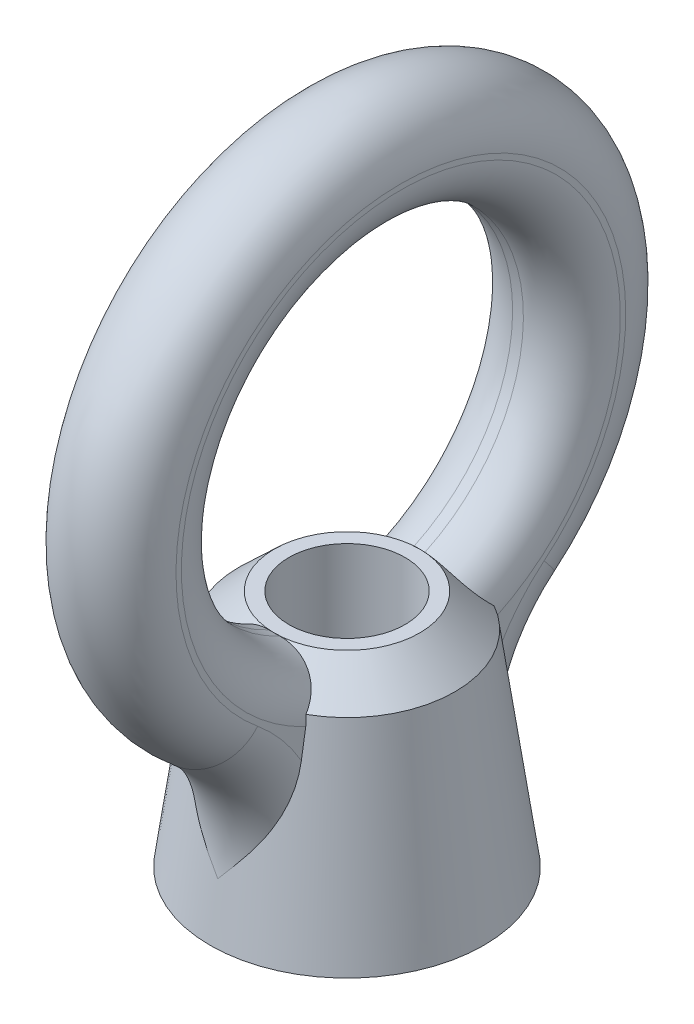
ISO-10303-21;
HEADER;
FILE_DESCRIPTION(('STEP AP214'),'2;1');
FILE_NAME('part.step','',(''),(''),'','','');
FILE_SCHEMA(('AUTOMOTIVE_DESIGN { 1 0 10303 214 1 1 1 1 }'));
ENDSEC;
DATA;
#1=APPLICATION_CONTEXT('core data for automotive mechanical design processes');
#2=APPLICATION_PROTOCOL_DEFINITION('international standard','automotive_design',2000,#1);
#3=PRODUCT_CONTEXT('',#1,'mechanical');
#4=PRODUCT('Part','Part','',(#3));
#5=PRODUCT_RELATED_PRODUCT_CATEGORY('part','',(#4));
#6=PRODUCT_DEFINITION_FORMATION('','',#4);
#7=PRODUCT_DEFINITION_CONTEXT('part definition',#1,'design');
#8=PRODUCT_DEFINITION('design','',#6,#7);
#9=PRODUCT_DEFINITION_SHAPE('','',#8);
#10=(LENGTH_UNIT() NAMED_UNIT(*) SI_UNIT(.MILLI.,.METRE.));
#11=(NAMED_UNIT(*) PLANE_ANGLE_UNIT() SI_UNIT($,.RADIAN.));
#12=(NAMED_UNIT(*) SI_UNIT($,.STERADIAN.) SOLID_ANGLE_UNIT());
#13=UNCERTAINTY_MEASURE_WITH_UNIT(LENGTH_MEASURE(1.E-05),#10,'distance_accuracy_value','');
#14=(GEOMETRIC_REPRESENTATION_CONTEXT(3) GLOBAL_UNCERTAINTY_ASSIGNED_CONTEXT((#13)) GLOBAL_UNIT_ASSIGNED_CONTEXT((#10,
#11,#12)) REPRESENTATION_CONTEXT('',''));
#15=CARTESIAN_POINT('',(0.,0.,0.));
#16=DIRECTION('',(0.,0.,1.));
#17=DIRECTION('',(1.,0.,0.));
#18=AXIS2_PLACEMENT_3D('',#15,#16,#17);
#19=CARTESIAN_POINT('',(0.,-18.7322191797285,15.4788231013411));
#20=DIRECTION('',(-1.,0.,0.));
#21=DIRECTION('',(0.,0.,1.));
#22=AXIS2_PLACEMENT_3D('',#19,#20,#21);
#23=TOROIDAL_SURFACE('',#22,11.15,3.15);
#24=CARTESIAN_POINT('',(0.,-19.8456039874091,7.55667855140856));
#25=CARTESIAN_POINT('',(-0.00377779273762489,-19.8410354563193,7.55603649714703));
#26=CARTESIAN_POINT('',(-0.00755579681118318,-19.8364674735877,7.55539167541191));
#27=CARTESIAN_POINT('',(-0.125643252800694,-19.6937116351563,7.53515114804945));
#28=CARTESIAN_POINT('',(-0.24012256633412,-19.5560100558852,7.51302191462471));
#29=CARTESIAN_POINT('',(-0.468015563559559,-19.280651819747,7.46350439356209));
#30=CARTESIAN_POINT('',(-0.581429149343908,-19.1429951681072,7.43611562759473));
#31=CARTESIAN_POINT('',(-0.805830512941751,-18.8667077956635,7.37610027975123));
#32=CARTESIAN_POINT('',(-0.916816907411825,-18.7280765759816,7.34347079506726));
#33=CARTESIAN_POINT('',(-1.13487946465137,-18.4490027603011,7.27325639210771));
#34=CARTESIAN_POINT('',(-1.24195577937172,-18.30856023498,7.23567166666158));
#35=CARTESIAN_POINT('',(-1.45064620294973,-18.0252440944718,7.15611617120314));
#36=CARTESIAN_POINT('',(-1.55226896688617,-17.8823748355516,7.11415268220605));
#37=CARTESIAN_POINT('',(-1.74892158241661,-17.5932481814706,7.02651705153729));
#38=CARTESIAN_POINT('',(-1.84395111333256,-17.4469906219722,6.98084472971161));
#39=CARTESIAN_POINT('',(-2.02609624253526,-17.1506459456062,6.88677246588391));
#40=CARTESIAN_POINT('',(-2.11321859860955,-17.0005622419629,6.83837491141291));
#41=CARTESIAN_POINT('',(-2.27850965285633,-16.6960915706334,6.73994112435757));
#42=CARTESIAN_POINT('',(-2.35668005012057,-16.5417054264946,6.68990520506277));
#43=CARTESIAN_POINT('',(-2.51582105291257,-16.201237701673,6.58071125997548));
#44=CARTESIAN_POINT('',(-2.59492719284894,-16.0143018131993,6.52147579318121));
#45=CARTESIAN_POINT('',(-2.73824234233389,-15.6343064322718,6.40457565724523));
#46=CARTESIAN_POINT('',(-2.80245156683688,-15.4412470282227,6.34691096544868));
#47=CARTESIAN_POINT('',(-2.91515012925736,-15.0492452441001,6.2351871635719));
#48=CARTESIAN_POINT('',(-2.96361808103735,-14.850295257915,6.18113303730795));
#49=CARTESIAN_POINT('',(-3.04413589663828,-14.4476688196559,6.07866370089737));
#50=CARTESIAN_POINT('',(-3.07618661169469,-14.2439926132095,6.03024819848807));
#51=CARTESIAN_POINT('',(-3.12371395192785,-13.831822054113,5.94040082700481));
#52=CARTESIAN_POINT('',(-3.13908520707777,-13.6233054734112,5.89901473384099));
#53=CARTESIAN_POINT('',(-3.15274159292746,-13.2041293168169,5.82482816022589));
#54=CARTESIAN_POINT('',(-3.15102259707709,-12.9934692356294,5.7920297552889));
#55=CARTESIAN_POINT('',(-3.13038275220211,-12.5722115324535,5.73585401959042));
#56=CARTESIAN_POINT('',(-3.1114998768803,-12.3616147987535,5.7124560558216));
#57=CARTESIAN_POINT('',(-3.05633264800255,-11.9419661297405,5.67526591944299));
#58=CARTESIAN_POINT('',(-3.02006194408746,-11.7329131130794,5.66146623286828));
#59=CARTESIAN_POINT('',(-2.95552182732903,-11.437208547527,5.64846588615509));
#60=CARTESIAN_POINT('',(-2.93457913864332,-11.3490686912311,5.64543092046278));
#61=CARTESIAN_POINT('',(-2.88937794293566,-11.1737238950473,5.64102394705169));
#62=CARTESIAN_POINT('',(-2.86512376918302,-11.0865178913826,5.63964978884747));
#63=CARTESIAN_POINT('',(-2.83916194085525,-10.9998,5.63907907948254));
#64=B_SPLINE_CURVE_WITH_KNOTS('',3,(#24,#25,#26,#27,#28,#29,#30,#31,#32,#33,#34,#35,#36,#37,#38,
#39,#40,#41,#42,#43,#44,#45,#46,#47,#48,#49,#50,#51,#52,#53,#54,#55,#56,#57,#58,#59,#60,#61,#62,
#63),.UNSPECIFIED.,.F.,.F.,(4,2,2,2,2,2,2,2,2,2,2,2,2,2,2,2,2,2,2,4),(0.,0.0178885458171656,
0.559107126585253,1.10037495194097,1.64194362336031,2.18349122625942,2.72415227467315,
3.26483960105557,3.8050603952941,4.34517848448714,4.97894479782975,5.61270196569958,
6.24731659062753,6.88189830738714,7.52046597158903,8.15918782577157,8.79649998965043,
9.43331267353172,9.70517970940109,9.97669434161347),.UNSPECIFIED.);
#65=CARTESIAN_POINT('',(0.,-19.8456039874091,7.55667855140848));
#66=VERTEX_POINT('',#65);
#67=CARTESIAN_POINT('',(-3.15,-13.1624752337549,5.81960717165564));
#68=VERTEX_POINT('',#67);
#69=EDGE_CURVE('E58',#66,#68,#64,.T.);
#70=ORIENTED_EDGE('',*,*,#69,.F.);
#71=CARTESIAN_POINT('',(0.,-19.8456039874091,7.55667855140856));
#72=CARTESIAN_POINT('',(0.00377779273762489,-19.8410354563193,7.55603649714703));
#73=CARTESIAN_POINT('',(0.00755579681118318,-19.8364674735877,7.55539167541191));
#74=CARTESIAN_POINT('',(0.125643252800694,-19.6937116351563,7.53515114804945));
#75=CARTESIAN_POINT('',(0.24012256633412,-19.5560100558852,7.51302191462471));
#76=CARTESIAN_POINT('',(0.468015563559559,-19.280651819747,7.46350439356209));
#77=CARTESIAN_POINT('',(0.581429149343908,-19.1429951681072,7.43611562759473));
#78=CARTESIAN_POINT('',(0.805830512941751,-18.8667077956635,7.37610027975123));
#79=CARTESIAN_POINT('',(0.916816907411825,-18.7280765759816,7.34347079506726));
#80=CARTESIAN_POINT('',(1.13487946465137,-18.4490027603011,7.27325639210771));
#81=CARTESIAN_POINT('',(1.24195577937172,-18.30856023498,7.23567166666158));
#82=CARTESIAN_POINT('',(1.45064620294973,-18.0252440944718,7.15611617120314));
#83=CARTESIAN_POINT('',(1.55226896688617,-17.8823748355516,7.11415268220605));
#84=CARTESIAN_POINT('',(1.74892158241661,-17.5932481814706,7.02651705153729));
#85=CARTESIAN_POINT('',(1.84395111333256,-17.4469906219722,6.98084472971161));
#86=CARTESIAN_POINT('',(2.02609624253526,-17.1506459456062,6.88677246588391));
#87=CARTESIAN_POINT('',(2.11321859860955,-17.0005622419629,6.83837491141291));
#88=CARTESIAN_POINT('',(2.27850965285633,-16.6960915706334,6.73994112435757));
#89=CARTESIAN_POINT('',(2.35668005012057,-16.5417054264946,6.68990520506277));
#90=CARTESIAN_POINT('',(2.51582105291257,-16.201237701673,6.58071125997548));
#91=CARTESIAN_POINT('',(2.59492719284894,-16.0143018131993,6.52147579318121));
#92=CARTESIAN_POINT('',(2.73824234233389,-15.6343064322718,6.40457565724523));
#93=CARTESIAN_POINT('',(2.80245156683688,-15.4412470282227,6.34691096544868));
#94=CARTESIAN_POINT('',(2.91515012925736,-15.0492452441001,6.2351871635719));
#95=CARTESIAN_POINT('',(2.96361808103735,-14.850295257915,6.18113303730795));
#96=CARTESIAN_POINT('',(3.04413589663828,-14.4476688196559,6.07866370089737));
#97=CARTESIAN_POINT('',(3.07618661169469,-14.2439926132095,6.03024819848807));
#98=CARTESIAN_POINT('',(3.12371395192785,-13.831822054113,5.94040082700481));
#99=CARTESIAN_POINT('',(3.13908520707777,-13.6233054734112,5.89901473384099));
#100=CARTESIAN_POINT('',(3.15274159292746,-13.2041293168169,5.82482816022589));
#101=CARTESIAN_POINT('',(3.15102259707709,-12.9934692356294,5.7920297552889));
#102=CARTESIAN_POINT('',(3.13038275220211,-12.5722115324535,5.73585401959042));
#103=CARTESIAN_POINT('',(3.1114998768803,-12.3616147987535,5.7124560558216));
#104=CARTESIAN_POINT('',(3.05633264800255,-11.9419661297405,5.67526591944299));
#105=CARTESIAN_POINT('',(3.02006194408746,-11.7329131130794,5.66146623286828));
#106=CARTESIAN_POINT('',(2.95552182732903,-11.437208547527,5.64846588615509));
#107=CARTESIAN_POINT('',(2.93457913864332,-11.3490686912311,5.64543092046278));
#108=CARTESIAN_POINT('',(2.88937794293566,-11.1737238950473,5.64102394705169));
#109=CARTESIAN_POINT('',(2.86512376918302,-11.0865178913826,5.63964978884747));
#110=CARTESIAN_POINT('',(2.83916194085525,-10.9998,5.63907907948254));
#111=B_SPLINE_CURVE_WITH_KNOTS('',3,(#71,#72,#73,#74,#75,#76,#77,#78,#79,#80,#81,#82,#83,#84,
#85,#86,#87,#88,#89,#90,#91,#92,#93,#94,#95,#96,#97,#98,#99,#100,#101,#102,#103,#104,#105,#106,
#107,#108,#109,#110),.UNSPECIFIED.,.F.,.F.,(4,2,2,2,2,2,2,2,2,2,2,2,2,2,2,2,2,2,2,4),(0.,
0.0178885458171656,0.559107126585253,1.10037495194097,1.64194362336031,2.18349122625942,
2.72415227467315,3.26483960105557,3.8050603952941,4.34517848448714,4.97894479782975,
5.61270196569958,6.24731659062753,6.88189830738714,7.52046597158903,8.15918782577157,
8.79649998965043,9.43331267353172,9.70517970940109,9.97669434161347),.UNSPECIFIED.);
#112=CARTESIAN_POINT('',(3.15,-13.1624752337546,5.81960717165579));
#113=VERTEX_POINT('',#112);
#114=EDGE_CURVE('E427',#113,#66,#111,.F.);
#115=ORIENTED_EDGE('',*,*,#114,.F.);
#116=CARTESIAN_POINT('',(3.15,-18.7322191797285,15.4788231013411));
#117=DIRECTION('',(1.,0.,0.));
#118=DIRECTION('',(0.,0.,-1.));
#119=AXIS2_PLACEMENT_3D('',#116,#117,#118);
#120=CIRCLE('',#119,11.15);
#121=CARTESIAN_POINT('',(3.15,-10.136982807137,8.37640015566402));
#122=VERTEX_POINT('',#121);
#123=EDGE_CURVE('E437',#122,#113,#120,.F.);
#124=ORIENTED_EDGE('',*,*,#123,.F.);
#125=CARTESIAN_POINT('',(0.,-10.136982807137,8.37640015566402));
#126=DIRECTION('',(0.,-0.636988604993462,-0.770873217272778));
#127=DIRECTION('',(0.,0.770873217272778,-0.636988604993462));
#128=AXIS2_PLACEMENT_3D('',#125,#126,#127);
#129=CIRCLE('',#128,3.15);
#130=CARTESIAN_POINT('',(-3.15,-10.136982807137,8.37640015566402));
#131=VERTEX_POINT('',#130);
#132=EDGE_CURVE('E280',#122,#131,#129,.T.);
#133=ORIENTED_EDGE('',*,*,#132,.T.);
#134=CARTESIAN_POINT('',(-3.15,-18.7322191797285,15.4788231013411));
#135=DIRECTION('',(1.,0.,0.));
#136=DIRECTION('',(0.,0.,-1.));
#137=AXIS2_PLACEMENT_3D('',#134,#135,#136);
#138=CIRCLE('',#137,11.15);
#139=EDGE_CURVE('E282',#68,#131,#138,.T.);
#140=ORIENTED_EDGE('',*,*,#139,.F.);
#141=EDGE_LOOP('',(#70,#115,#124,#133,#140));
#142=FACE_BOUND('',#141,.T.);
#143=ADVANCED_FACE('F33',(#142),#23,.T.);
#144=CARTESIAN_POINT('',(0.,0.,0.));
#145=DIRECTION('',(1.,0.,0.));
#146=DIRECTION('',(0.,0.,-1.));
#147=AXIS2_PLACEMENT_3D('',#144,#145,#146);
#148=TOROIDAL_SURFACE('',#147,13.15,3.15);
#149=ORIENTED_EDGE('',*,*,#132,.F.);
#150=CARTESIAN_POINT('',(3.15,0.,0.));
#151=DIRECTION('',(1.,0.,0.));
#152=DIRECTION('',(0.,0.,-1.));
#153=AXIS2_PLACEMENT_3D('',#150,#151,#152);
#154=CIRCLE('',#153,13.15);
#155=CARTESIAN_POINT('',(3.15,-10.136982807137,-8.37640015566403));
#156=VERTEX_POINT('',#155);
#157=EDGE_CURVE('E438',#156,#122,#154,.T.);
#158=ORIENTED_EDGE('',*,*,#157,.F.);
#159=CARTESIAN_POINT('',(0.,-10.136982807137,-8.37640015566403));
#160=DIRECTION('',(0.,0.636988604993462,-0.770873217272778));
#161=DIRECTION('',(0.,0.770873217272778,0.636988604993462));
#162=AXIS2_PLACEMENT_3D('',#159,#160,#161);
#163=CIRCLE('',#162,3.15);
#164=CARTESIAN_POINT('',(-3.15,-10.136982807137,-8.37640015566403));
#165=VERTEX_POINT('',#164);
#166=EDGE_CURVE('E278',#156,#165,#163,.T.);
#167=ORIENTED_EDGE('',*,*,#166,.T.);
#168=CARTESIAN_POINT('',(-3.15,0.,0.));
#169=DIRECTION('',(1.,0.,0.));
#170=DIRECTION('',(0.,0.,-1.));
#171=AXIS2_PLACEMENT_3D('',#168,#169,#170);
#172=CIRCLE('',#171,13.15);
#173=EDGE_CURVE('E276',#131,#165,#172,.F.);
#174=ORIENTED_EDGE('',*,*,#173,.F.);
#175=EDGE_LOOP('',(#149,#158,#167,#174));
#176=FACE_BOUND('',#175,.T.);
#177=ADVANCED_FACE('F304',(#176),#148,.T.);
#178=CARTESIAN_POINT('',(0.,-18.7322191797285,-15.4788231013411));
#179=DIRECTION('',(-1.,0.,0.));
#180=DIRECTION('',(0.,0.,1.));
#181=AXIS2_PLACEMENT_3D('',#178,#179,#180);
#182=TOROIDAL_SURFACE('',#181,11.15,3.15);
#183=CARTESIAN_POINT('',(0.,-19.8456039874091,-7.55667855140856));
#184=CARTESIAN_POINT('',(0.00377779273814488,-19.8410354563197,-7.55603649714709));
#185=CARTESIAN_POINT('',(0.00755579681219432,-19.8364674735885,-7.55539167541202));
#186=CARTESIAN_POINT('',(0.125643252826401,-19.6937116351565,-7.53515114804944));
#187=CARTESIAN_POINT('',(0.240122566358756,-19.556010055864,-7.51302191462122));
#188=CARTESIAN_POINT('',(0.468015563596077,-19.2806518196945,-7.46350439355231));
#189=CARTESIAN_POINT('',(0.581429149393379,-19.1429951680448,-7.43611562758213));
#190=CARTESIAN_POINT('',(0.805830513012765,-18.8667077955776,-7.37610027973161));
#191=CARTESIAN_POINT('',(0.916816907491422,-18.7280765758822,-7.34347079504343));
#192=CARTESIAN_POINT('',(1.13487946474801,-18.449002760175,-7.2732563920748));
#193=CARTESIAN_POINT('',(1.24195577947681,-18.3085602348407,-7.2356716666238));
#194=CARTESIAN_POINT('',(1.4506462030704,-18.0252440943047,-7.15611617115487));
#195=CARTESIAN_POINT('',(1.55226896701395,-17.8823748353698,-7.11415268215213));
#196=CARTESIAN_POINT('',(1.7489215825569,-17.5932481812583,-7.02651705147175));
#197=CARTESIAN_POINT('',(1.84395111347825,-17.4469906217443,-6.98084472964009));
#198=CARTESIAN_POINT('',(2.02609624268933,-17.1506459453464,-6.88677246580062));
#199=CARTESIAN_POINT('',(2.11321859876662,-17.0005622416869,-6.83837491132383));
#200=CARTESIAN_POINT('',(2.27850965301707,-16.696091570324,-6.73994112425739));
#201=CARTESIAN_POINT('',(2.35668005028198,-16.5417054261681,-6.68990520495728));
#202=CARTESIAN_POINT('',(2.51582105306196,-16.2012377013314,-6.58071125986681));
#203=CARTESIAN_POINT('',(2.59492719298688,-16.0143018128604,-6.52147579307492));
#204=CARTESIAN_POINT('',(2.73824234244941,-15.6343064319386,-6.40457565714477));
#205=CARTESIAN_POINT('',(2.80245156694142,-15.4412470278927,-6.34691096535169));
#206=CARTESIAN_POINT('',(2.91515012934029,-15.049245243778,-6.23518716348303));
#207=CARTESIAN_POINT('',(2.96361808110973,-14.8502952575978,-6.18113303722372));
#208=CARTESIAN_POINT('',(3.04413589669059,-14.4476688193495,-6.07866370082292));
#209=CARTESIAN_POINT('',(3.0761866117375,-14.2439926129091,-6.03024819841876));
#210=CARTESIAN_POINT('',(3.12371395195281,-13.8318220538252,-5.94040082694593));
#211=CARTESIAN_POINT('',(3.13908520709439,-13.6233054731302,-5.89901473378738));
#212=CARTESIAN_POINT('',(3.15274159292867,-13.2041293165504,-5.82482816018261));
#213=CARTESIAN_POINT('',(3.15102259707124,-12.9934692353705,-5.79202975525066));
#214=CARTESIAN_POINT('',(3.13038275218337,-12.5722115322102,-5.73585401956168));
#215=CARTESIAN_POINT('',(3.11149987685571,-12.3616147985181,-5.71245605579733));
#216=CARTESIAN_POINT('',(3.05633264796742,-11.9419661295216,-5.67526591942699));
#217=CARTESIAN_POINT('',(3.02006194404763,-11.732913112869,-5.66146623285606));
#218=CARTESIAN_POINT('',(2.95552182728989,-11.4372085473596,-5.64846588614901));
#219=CARTESIAN_POINT('',(2.93457913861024,-11.3490686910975,-5.6454309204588));
#220=CARTESIAN_POINT('',(2.88937794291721,-11.173723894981,-5.64102394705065));
#221=CARTESIAN_POINT('',(2.86512376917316,-11.0865178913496,-5.63964978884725));
#222=CARTESIAN_POINT('',(2.83916194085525,-10.9998,-5.63907907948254));
#223=B_SPLINE_CURVE_WITH_KNOTS('',3,(#183,#184,#185,#186,#187,#188,#189,#190,#191,#192,#193,
#194,#195,#196,#197,#198,#199,#200,#201,#202,#203,#204,#205,#206,#207,#208,#209,#210,#211,#212,
#213,#214,#215,#216,#217,#218,#219,#220,#221,#222),.UNSPECIFIED.,.F.,.F.,(4,2,2,2,2,2,2,2,2,2,2,
2,2,2,2,2,2,2,2,4),(0.,0.0178885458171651,0.559107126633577,1.10037495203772,1.64194362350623,
2.18349122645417,2.72415227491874,3.26483960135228,3.80506039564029,4.34517848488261,
4.97894479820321,5.61270196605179,6.24731659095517,6.88189830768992,7.52046597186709,
8.159187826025,8.79649998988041,9.4333126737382,9.70517970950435,9.97669434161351),.UNSPECIFIED.);
#224=CARTESIAN_POINT('',(0.,-19.8456039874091,-7.55667855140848));
#225=VERTEX_POINT('',#224);
#226=CARTESIAN_POINT('',(3.15,-13.1624752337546,-5.81960717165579));
#227=VERTEX_POINT('',#226);
#228=EDGE_CURVE('E50',#225,#227,#223,.T.);
#229=ORIENTED_EDGE('',*,*,#228,.F.);
#230=CARTESIAN_POINT('',(0.,-19.8456039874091,-7.55667855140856));
#231=CARTESIAN_POINT('',(-0.00377779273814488,-19.8410354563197,-7.55603649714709));
#232=CARTESIAN_POINT('',(-0.00755579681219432,-19.8364674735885,-7.55539167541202));
#233=CARTESIAN_POINT('',(-0.125643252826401,-19.6937116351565,-7.53515114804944));
#234=CARTESIAN_POINT('',(-0.240122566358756,-19.556010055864,-7.51302191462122));
#235=CARTESIAN_POINT('',(-0.468015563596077,-19.2806518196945,-7.46350439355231));
#236=CARTESIAN_POINT('',(-0.581429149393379,-19.1429951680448,-7.43611562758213));
#237=CARTESIAN_POINT('',(-0.805830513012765,-18.8667077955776,-7.37610027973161));
#238=CARTESIAN_POINT('',(-0.916816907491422,-18.7280765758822,-7.34347079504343));
#239=CARTESIAN_POINT('',(-1.13487946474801,-18.449002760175,-7.2732563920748));
#240=CARTESIAN_POINT('',(-1.24195577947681,-18.3085602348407,-7.2356716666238));
#241=CARTESIAN_POINT('',(-1.4506462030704,-18.0252440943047,-7.15611617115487));
#242=CARTESIAN_POINT('',(-1.55226896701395,-17.8823748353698,-7.11415268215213));
#243=CARTESIAN_POINT('',(-1.7489215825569,-17.5932481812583,-7.02651705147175));
#244=CARTESIAN_POINT('',(-1.84395111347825,-17.4469906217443,-6.98084472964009));
#245=CARTESIAN_POINT('',(-2.02609624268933,-17.1506459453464,-6.88677246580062));
#246=CARTESIAN_POINT('',(-2.11321859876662,-17.0005622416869,-6.83837491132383));
#247=CARTESIAN_POINT('',(-2.27850965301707,-16.696091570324,-6.73994112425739));
#248=CARTESIAN_POINT('',(-2.35668005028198,-16.5417054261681,-6.68990520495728));
#249=CARTESIAN_POINT('',(-2.51582105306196,-16.2012377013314,-6.58071125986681));
#250=CARTESIAN_POINT('',(-2.59492719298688,-16.0143018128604,-6.52147579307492));
#251=CARTESIAN_POINT('',(-2.73824234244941,-15.6343064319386,-6.40457565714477));
#252=CARTESIAN_POINT('',(-2.80245156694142,-15.4412470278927,-6.34691096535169));
#253=CARTESIAN_POINT('',(-2.91515012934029,-15.049245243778,-6.23518716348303));
#254=CARTESIAN_POINT('',(-2.96361808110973,-14.8502952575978,-6.18113303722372));
#255=CARTESIAN_POINT('',(-3.04413589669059,-14.4476688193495,-6.07866370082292));
#256=CARTESIAN_POINT('',(-3.0761866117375,-14.2439926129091,-6.03024819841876));
#257=CARTESIAN_POINT('',(-3.12371395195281,-13.8318220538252,-5.94040082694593));
#258=CARTESIAN_POINT('',(-3.13908520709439,-13.6233054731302,-5.89901473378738));
#259=CARTESIAN_POINT('',(-3.15274159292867,-13.2041293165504,-5.82482816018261));
#260=CARTESIAN_POINT('',(-3.15102259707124,-12.9934692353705,-5.79202975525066));
#261=CARTESIAN_POINT('',(-3.13038275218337,-12.5722115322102,-5.73585401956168));
#262=CARTESIAN_POINT('',(-3.11149987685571,-12.3616147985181,-5.71245605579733));
#263=CARTESIAN_POINT('',(-3.05633264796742,-11.9419661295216,-5.67526591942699));
#264=CARTESIAN_POINT('',(-3.02006194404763,-11.732913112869,-5.66146623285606));
#265=CARTESIAN_POINT('',(-2.95552182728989,-11.4372085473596,-5.64846588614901));
#266=CARTESIAN_POINT('',(-2.93457913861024,-11.3490686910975,-5.6454309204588));
#267=CARTESIAN_POINT('',(-2.88937794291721,-11.173723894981,-5.64102394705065));
#268=CARTESIAN_POINT('',(-2.86512376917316,-11.0865178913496,-5.63964978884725));
#269=CARTESIAN_POINT('',(-2.83916194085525,-10.9998,-5.63907907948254));
#270=B_SPLINE_CURVE_WITH_KNOTS('',3,(#230,#231,#232,#233,#234,#235,#236,#237,#238,#239,#240,
#241,#242,#243,#244,#245,#246,#247,#248,#249,#250,#251,#252,#253,#254,#255,#256,#257,#258,#259,
#260,#261,#262,#263,#264,#265,#266,#267,#268,#269),.UNSPECIFIED.,.F.,.F.,(4,2,2,2,2,2,2,2,2,2,2,
2,2,2,2,2,2,2,2,4),(0.,0.0178885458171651,0.559107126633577,1.10037495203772,1.64194362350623,
2.18349122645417,2.72415227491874,3.26483960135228,3.80506039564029,4.34517848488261,
4.97894479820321,5.61270196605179,6.24731659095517,6.88189830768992,7.52046597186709,
8.159187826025,8.79649998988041,9.4333126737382,9.70517970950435,9.97669434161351),.UNSPECIFIED.);
#271=CARTESIAN_POINT('',(-3.15,-13.1624752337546,-5.81960717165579));
#272=VERTEX_POINT('',#271);
#273=EDGE_CURVE('E195',#272,#225,#270,.F.);
#274=ORIENTED_EDGE('',*,*,#273,.F.);
#275=CARTESIAN_POINT('',(-3.15,-18.7322191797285,-15.4788231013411));
#276=DIRECTION('',(1.,0.,0.));
#277=DIRECTION('',(0.,0.,-1.));
#278=AXIS2_PLACEMENT_3D('',#275,#276,#277);
#279=CIRCLE('',#278,11.15);
#280=EDGE_CURVE('E274',#165,#272,#279,.T.);
#281=ORIENTED_EDGE('',*,*,#280,.F.);
#282=ORIENTED_EDGE('',*,*,#166,.F.);
#283=CARTESIAN_POINT('',(3.15,-18.7322191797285,-15.4788231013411));
#284=DIRECTION('',(1.,0.,0.));
#285=DIRECTION('',(0.,0.,-1.));
#286=AXIS2_PLACEMENT_3D('',#283,#284,#285);
#287=CIRCLE('',#286,11.15);
#288=EDGE_CURVE('E446',#227,#156,#287,.F.);
#289=ORIENTED_EDGE('',*,*,#288,.F.);
#290=EDGE_LOOP('',(#229,#274,#281,#282,#289));
#291=FACE_BOUND('',#290,.T.);
#292=ADVANCED_FACE('F185',(#291),#182,.T.);
#293=CARTESIAN_POINT('',(3.15,0.,0.));
#294=DIRECTION('',(1.,0.,0.));
#295=DIRECTION('',(0.,0.,-1.));
#296=AXIS2_PLACEMENT_3D('',#293,#294,#295);
#297=PLANE('',#296);
#298=CARTESIAN_POINT('',(3.15,-31.524957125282,-8.64191113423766));
#299=CARTESIAN_POINT('',(3.15,-30.4551220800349,-8.48187544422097));
#300=CARTESIAN_POINT('',(3.15,-29.3853622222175,-8.32133856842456));
#301=CARTESIAN_POINT('',(3.15,-27.2460276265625,-7.99905016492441));
#302=CARTESIAN_POINT('',(3.15,-26.1764528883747,-7.837298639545));
#303=CARTESIAN_POINT('',(3.15,-22.9676605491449,-7.34984323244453));
#304=CARTESIAN_POINT('',(3.15,-20.8287667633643,-7.02199699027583));
#305=CARTESIAN_POINT('',(3.15,-17.6214369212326,-6.52374933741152));
#306=CARTESIAN_POINT('',(3.15,-16.5524976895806,-6.3565874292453));
#307=CARTESIAN_POINT('',(3.15,-14.4150607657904,-6.01951382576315));
#308=CARTESIAN_POINT('',(3.15,-13.3465630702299,-5.84960215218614));
#309=CARTESIAN_POINT('',(3.15,-11.2102841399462,-5.50625900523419));
#310=CARTESIAN_POINT('',(3.15,-10.1425028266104,-5.33282802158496));
#311=CARTESIAN_POINT('',(3.15,-8.00768017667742,-4.98126491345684));
#312=CARTESIAN_POINT('',(3.15,-6.94063886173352,-4.80313265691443));
#313=CARTESIAN_POINT('',(3.15,-5.34073276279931,-4.53101374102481));
#314=CARTESIAN_POINT('',(3.15,-4.80745219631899,-4.43947185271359));
#315=CARTESIAN_POINT('',(3.15,-3.74123434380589,-4.25441940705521));
#316=CARTESIAN_POINT('',(3.15,-3.20829705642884,-4.16090885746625));
#317=CARTESIAN_POINT('',(3.15,-2.14288992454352,-3.97150229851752));
#318=CARTESIAN_POINT('',(3.15,-1.61042004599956,-3.87560648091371));
#319=CARTESIAN_POINT('',(3.15,-0.546014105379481,-3.68084480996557));
#320=CARTESIAN_POINT('',(3.15,-0.0140780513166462,-3.58197891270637));
#321=CARTESIAN_POINT('',(3.15,1.04928257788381,-3.38043515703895));
#322=CARTESIAN_POINT('',(3.15,1.58070688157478,-3.27775586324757));
#323=CARTESIAN_POINT('',(3.15,2.64256376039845,-3.06746644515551));
#324=CARTESIAN_POINT('',(3.15,3.17299637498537,-2.9598565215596));
#325=CARTESIAN_POINT('',(3.15,3.96765700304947,-2.79334938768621));
#326=CARTESIAN_POINT('',(3.15,4.23241662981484,-2.73698995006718));
#327=CARTESIAN_POINT('',(3.15,4.76149086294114,-2.62223258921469));
#328=CARTESIAN_POINT('',(3.15,5.02580547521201,-2.5638346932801));
#329=CARTESIAN_POINT('',(3.15,5.55391817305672,-2.44457239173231));
#330=CARTESIAN_POINT('',(3.15,5.8177161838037,-2.38370765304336));
#331=CARTESIAN_POINT('',(3.15,6.3445859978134,-2.25886514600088));
#332=CARTESIAN_POINT('',(3.15,6.60765776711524,-2.19488723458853));
#333=CARTESIAN_POINT('',(3.15,6.87026738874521,-2.12902852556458));
#334=B_SPLINE_CURVE_WITH_KNOTS('',3,(#298,#299,#300,#301,#302,#303,#304,#305,#306,#307,#308,
#309,#310,#311,#312,#313,#314,#315,#316,#317,#318,#319,#320,#321,#322,#323,#324,#325,#326,#327,
#328,#329,#330,#331,#332,#333),.UNSPECIFIED.,.F.,.F.,(4,2,2,2,2,2,2,2,2,2,2,2,2,2,2,2,2,4),(0.,
3.24521519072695,6.49042417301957,12.9820309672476,16.2278207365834,19.4735848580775,
22.7189003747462,25.9643071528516,27.5875457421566,29.2107779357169,30.8338800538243,
32.4570061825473,34.0807495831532,35.7044269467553,36.5164959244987,37.3285540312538,
38.1407221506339,38.952927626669),.UNSPECIFIED.);
#335=CARTESIAN_POINT('',(3.15,-11.5666499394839,-5.563257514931));
#336=VERTEX_POINT('',#335);
#337=EDGE_CURVE('E204',#227,#336,#334,.T.);
#338=ORIENTED_EDGE('',*,*,#337,.F.);
#339=ORIENTED_EDGE('',*,*,#288,.T.);
#340=ORIENTED_EDGE('',*,*,#157,.T.);
#341=ORIENTED_EDGE('',*,*,#123,.T.);
#342=CARTESIAN_POINT('',(3.15,-31.524957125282,8.64191113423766));
#343=CARTESIAN_POINT('',(3.15,-30.4551220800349,8.48187544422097));
#344=CARTESIAN_POINT('',(3.15,-29.3853622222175,8.32133856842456));
#345=CARTESIAN_POINT('',(3.15,-27.2460276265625,7.99905016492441));
#346=CARTESIAN_POINT('',(3.15,-26.1764528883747,7.837298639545));
#347=CARTESIAN_POINT('',(3.15,-22.9676605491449,7.34984323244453));
#348=CARTESIAN_POINT('',(3.15,-20.8287667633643,7.02199699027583));
#349=CARTESIAN_POINT('',(3.15,-17.6214369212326,6.52374933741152));
#350=CARTESIAN_POINT('',(3.15,-16.5524976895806,6.3565874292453));
#351=CARTESIAN_POINT('',(3.15,-14.4150607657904,6.01951382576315));
#352=CARTESIAN_POINT('',(3.15,-13.3465630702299,5.84960215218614));
#353=CARTESIAN_POINT('',(3.15,-11.2102841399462,5.50625900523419));
#354=CARTESIAN_POINT('',(3.15,-10.1425028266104,5.33282802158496));
#355=CARTESIAN_POINT('',(3.15,-8.00768017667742,4.98126491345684));
#356=CARTESIAN_POINT('',(3.15,-6.94063886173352,4.80313265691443));
#357=CARTESIAN_POINT('',(3.15,-5.34073276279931,4.53101374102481));
#358=CARTESIAN_POINT('',(3.15,-4.80745219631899,4.43947185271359));
#359=CARTESIAN_POINT('',(3.15,-3.74123434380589,4.25441940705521));
#360=CARTESIAN_POINT('',(3.15,-3.20829705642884,4.16090885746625));
#361=CARTESIAN_POINT('',(3.15,-2.14288992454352,3.97150229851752));
#362=CARTESIAN_POINT('',(3.15,-1.61042004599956,3.87560648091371));
#363=CARTESIAN_POINT('',(3.15,-0.546014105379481,3.68084480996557));
#364=CARTESIAN_POINT('',(3.15,-0.0140780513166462,3.58197891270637));
#365=CARTESIAN_POINT('',(3.15,1.04928257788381,3.38043515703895));
#366=CARTESIAN_POINT('',(3.15,1.58070688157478,3.27775586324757));
#367=CARTESIAN_POINT('',(3.15,2.64256376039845,3.06746644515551));
#368=CARTESIAN_POINT('',(3.15,3.17299637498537,2.9598565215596));
#369=CARTESIAN_POINT('',(3.15,3.96765700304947,2.79334938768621));
#370=CARTESIAN_POINT('',(3.15,4.23241662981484,2.73698995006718));
#371=CARTESIAN_POINT('',(3.15,4.76149086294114,2.62223258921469));
#372=CARTESIAN_POINT('',(3.15,5.02580547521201,2.5638346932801));
#373=CARTESIAN_POINT('',(3.15,5.55391817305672,2.44457239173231));
#374=CARTESIAN_POINT('',(3.15,5.8177161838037,2.38370765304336));
#375=CARTESIAN_POINT('',(3.15,6.3445859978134,2.25886514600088));
#376=CARTESIAN_POINT('',(3.15,6.60765776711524,2.19488723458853));
#377=CARTESIAN_POINT('',(3.15,6.87026738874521,2.12902852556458));
#378=B_SPLINE_CURVE_WITH_KNOTS('',3,(#342,#343,#344,#345,#346,#347,#348,#349,#350,#351,#352,
#353,#354,#355,#356,#357,#358,#359,#360,#361,#362,#363,#364,#365,#366,#367,#368,#369,#370,#371,
#372,#373,#374,#375,#376,#377),.UNSPECIFIED.,.F.,.F.,(4,2,2,2,2,2,2,2,2,2,2,2,2,2,2,2,2,4),(0.,
3.24521519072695,6.49042417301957,12.9820309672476,16.2278207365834,19.4735848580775,
22.7189003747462,25.9643071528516,27.5875457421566,29.2107779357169,30.8338800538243,
32.4570061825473,34.0807495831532,35.7044269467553,36.5164959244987,37.3285540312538,
38.1407221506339,38.952927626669),.UNSPECIFIED.);
#379=CARTESIAN_POINT('',(3.15,-11.5666499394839,5.563257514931));
#380=VERTEX_POINT('',#379);
#381=EDGE_CURVE('E300',#380,#113,#378,.F.);
#382=ORIENTED_EDGE('',*,*,#381,.F.);
#383=CARTESIAN_POINT('',(3.15,0.,0.));
#384=DIRECTION('',(1.,0.,0.));
#385=DIRECTION('',(0.,0.,-1.));
#386=AXIS2_PLACEMENT_3D('',#383,#384,#385);
#387=CIRCLE('',#386,12.835);
#388=EDGE_CURVE('E269',#380,#336,#387,.F.);
#389=ORIENTED_EDGE('',*,*,#388,.T.);
#390=EDGE_LOOP('',(#338,#339,#340,#341,#382,#389));
#391=FACE_BOUND('',#390,.T.);
#392=ADVANCED_FACE('F181',(#391),#297,.T.);
#393=CARTESIAN_POINT('',(-3.15,0.,0.));
#394=DIRECTION('',(1.,0.,0.));
#395=DIRECTION('',(0.,0.,-1.));
#396=AXIS2_PLACEMENT_3D('',#393,#394,#395);
#397=PLANE('',#396);
#398=ORIENTED_EDGE('',*,*,#280,.T.);
#399=CARTESIAN_POINT('',(-3.15,-31.524957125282,-8.64191113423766));
#400=CARTESIAN_POINT('',(-3.15,-30.4551220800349,-8.48187544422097));
#401=CARTESIAN_POINT('',(-3.15,-29.3853622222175,-8.32133856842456));
#402=CARTESIAN_POINT('',(-3.15,-27.2460276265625,-7.99905016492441));
#403=CARTESIAN_POINT('',(-3.15,-26.1764528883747,-7.837298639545));
#404=CARTESIAN_POINT('',(-3.15,-22.9676605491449,-7.34984323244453));
#405=CARTESIAN_POINT('',(-3.15,-20.8287667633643,-7.02199699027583));
#406=CARTESIAN_POINT('',(-3.15,-17.6214369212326,-6.52374933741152));
#407=CARTESIAN_POINT('',(-3.15,-16.5524976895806,-6.3565874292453));
#408=CARTESIAN_POINT('',(-3.15,-14.4150607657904,-6.01951382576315));
#409=CARTESIAN_POINT('',(-3.15,-13.3465630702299,-5.84960215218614));
#410=CARTESIAN_POINT('',(-3.15,-11.2102841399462,-5.50625900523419));
#411=CARTESIAN_POINT('',(-3.15,-10.1425028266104,-5.33282802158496));
#412=CARTESIAN_POINT('',(-3.15,-8.00768017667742,-4.98126491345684));
#413=CARTESIAN_POINT('',(-3.15,-6.94063886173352,-4.80313265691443));
#414=CARTESIAN_POINT('',(-3.15,-5.34073276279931,-4.53101374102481));
#415=CARTESIAN_POINT('',(-3.15,-4.80745219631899,-4.43947185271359));
#416=CARTESIAN_POINT('',(-3.15,-3.74123434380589,-4.25441940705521));
#417=CARTESIAN_POINT('',(-3.15,-3.20829705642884,-4.16090885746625));
#418=CARTESIAN_POINT('',(-3.15,-2.14288992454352,-3.97150229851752));
#419=CARTESIAN_POINT('',(-3.15,-1.61042004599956,-3.87560648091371));
#420=CARTESIAN_POINT('',(-3.15,-0.546014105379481,-3.68084480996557));
#421=CARTESIAN_POINT('',(-3.15,-0.0140780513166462,-3.58197891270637));
#422=CARTESIAN_POINT('',(-3.15,1.04928257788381,-3.38043515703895));
#423=CARTESIAN_POINT('',(-3.15,1.58070688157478,-3.27775586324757));
#424=CARTESIAN_POINT('',(-3.15,2.64256376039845,-3.06746644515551));
#425=CARTESIAN_POINT('',(-3.15,3.17299637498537,-2.9598565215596));
#426=CARTESIAN_POINT('',(-3.15,3.96765700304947,-2.79334938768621));
#427=CARTESIAN_POINT('',(-3.15,4.23241662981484,-2.73698995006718));
#428=CARTESIAN_POINT('',(-3.15,4.76149086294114,-2.62223258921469));
#429=CARTESIAN_POINT('',(-3.15,5.02580547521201,-2.5638346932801));
#430=CARTESIAN_POINT('',(-3.15,5.55391817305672,-2.44457239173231));
#431=CARTESIAN_POINT('',(-3.15,5.8177161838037,-2.38370765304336));
#432=CARTESIAN_POINT('',(-3.15,6.3445859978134,-2.25886514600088));
#433=CARTESIAN_POINT('',(-3.15,6.60765776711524,-2.19488723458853));
#434=CARTESIAN_POINT('',(-3.15,6.87026738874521,-2.12902852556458));
#435=B_SPLINE_CURVE_WITH_KNOTS('',3,(#399,#400,#401,#402,#403,#404,#405,#406,#407,#408,#409,
#410,#411,#412,#413,#414,#415,#416,#417,#418,#419,#420,#421,#422,#423,#424,#425,#426,#427,#428,
#429,#430,#431,#432,#433,#434),.UNSPECIFIED.,.F.,.F.,(4,2,2,2,2,2,2,2,2,2,2,2,2,2,2,2,2,4),(0.,
3.24521519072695,6.49042417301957,12.9820309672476,16.2278207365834,19.4735848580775,
22.7189003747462,25.9643071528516,27.5875457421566,29.2107779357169,30.8338800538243,
32.4570061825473,34.0807495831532,35.7044269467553,36.5164959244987,37.3285540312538,
38.1407221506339,38.952927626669),.UNSPECIFIED.);
#436=CARTESIAN_POINT('',(-3.15,-11.5666499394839,-5.56325751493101));
#437=VERTEX_POINT('',#436);
#438=EDGE_CURVE('E189',#272,#437,#435,.T.);
#439=ORIENTED_EDGE('',*,*,#438,.T.);
#440=CARTESIAN_POINT('',(-3.15,0.,0.));
#441=DIRECTION('',(1.,0.,0.));
#442=DIRECTION('',(0.,0.,-1.));
#443=AXIS2_PLACEMENT_3D('',#440,#441,#442);
#444=CIRCLE('',#443,12.835);
#445=CARTESIAN_POINT('',(-3.15,-11.5666499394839,5.563257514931));
#446=VERTEX_POINT('',#445);
#447=EDGE_CURVE('E144',#437,#446,#444,.T.);
#448=ORIENTED_EDGE('',*,*,#447,.T.);
#449=CARTESIAN_POINT('',(-3.15,-31.524957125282,8.64191113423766));
#450=CARTESIAN_POINT('',(-3.15,-30.4551220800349,8.48187544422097));
#451=CARTESIAN_POINT('',(-3.15,-29.3853622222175,8.32133856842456));
#452=CARTESIAN_POINT('',(-3.15,-27.2460276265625,7.99905016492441));
#453=CARTESIAN_POINT('',(-3.15,-26.1764528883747,7.837298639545));
#454=CARTESIAN_POINT('',(-3.15,-22.9676605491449,7.34984323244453));
#455=CARTESIAN_POINT('',(-3.15,-20.8287667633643,7.02199699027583));
#456=CARTESIAN_POINT('',(-3.15,-17.6214369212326,6.52374933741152));
#457=CARTESIAN_POINT('',(-3.15,-16.5524976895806,6.3565874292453));
#458=CARTESIAN_POINT('',(-3.15,-14.4150607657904,6.01951382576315));
#459=CARTESIAN_POINT('',(-3.15,-13.3465630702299,5.84960215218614));
#460=CARTESIAN_POINT('',(-3.15,-11.2102841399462,5.50625900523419));
#461=CARTESIAN_POINT('',(-3.15,-10.1425028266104,5.33282802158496));
#462=CARTESIAN_POINT('',(-3.15,-8.00768017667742,4.98126491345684));
#463=CARTESIAN_POINT('',(-3.15,-6.94063886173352,4.80313265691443));
#464=CARTESIAN_POINT('',(-3.15,-5.34073276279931,4.53101374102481));
#465=CARTESIAN_POINT('',(-3.15,-4.80745219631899,4.43947185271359));
#466=CARTESIAN_POINT('',(-3.15,-3.74123434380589,4.25441940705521));
#467=CARTESIAN_POINT('',(-3.15,-3.20829705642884,4.16090885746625));
#468=CARTESIAN_POINT('',(-3.15,-2.14288992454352,3.97150229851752));
#469=CARTESIAN_POINT('',(-3.15,-1.61042004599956,3.87560648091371));
#470=CARTESIAN_POINT('',(-3.15,-0.546014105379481,3.68084480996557));
#471=CARTESIAN_POINT('',(-3.15,-0.0140780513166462,3.58197891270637));
#472=CARTESIAN_POINT('',(-3.15,1.04928257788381,3.38043515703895));
#473=CARTESIAN_POINT('',(-3.15,1.58070688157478,3.27775586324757));
#474=CARTESIAN_POINT('',(-3.15,2.64256376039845,3.06746644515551));
#475=CARTESIAN_POINT('',(-3.15,3.17299637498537,2.9598565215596));
#476=CARTESIAN_POINT('',(-3.15,3.96765700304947,2.79334938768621));
#477=CARTESIAN_POINT('',(-3.15,4.23241662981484,2.73698995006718));
#478=CARTESIAN_POINT('',(-3.15,4.76149086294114,2.62223258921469));
#479=CARTESIAN_POINT('',(-3.15,5.02580547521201,2.5638346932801));
#480=CARTESIAN_POINT('',(-3.15,5.55391817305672,2.44457239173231));
#481=CARTESIAN_POINT('',(-3.15,5.8177161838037,2.38370765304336));
#482=CARTESIAN_POINT('',(-3.15,6.3445859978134,2.25886514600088));
#483=CARTESIAN_POINT('',(-3.15,6.60765776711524,2.19488723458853));
#484=CARTESIAN_POINT('',(-3.15,6.87026738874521,2.12902852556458));
#485=B_SPLINE_CURVE_WITH_KNOTS('',3,(#449,#450,#451,#452,#453,#454,#455,#456,#457,#458,#459,
#460,#461,#462,#463,#464,#465,#466,#467,#468,#469,#470,#471,#472,#473,#474,#475,#476,#477,#478,
#479,#480,#481,#482,#483,#484),.UNSPECIFIED.,.F.,.F.,(4,2,2,2,2,2,2,2,2,2,2,2,2,2,2,2,2,4),(0.,
3.24521519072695,6.49042417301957,12.9820309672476,16.2278207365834,19.4735848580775,
22.7189003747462,25.9643071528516,27.5875457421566,29.2107779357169,30.8338800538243,
32.4570061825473,34.0807495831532,35.7044269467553,36.5164959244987,37.3285540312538,
38.1407221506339,38.952927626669),.UNSPECIFIED.);
#486=EDGE_CURVE('E143',#446,#68,#485,.F.);
#487=ORIENTED_EDGE('',*,*,#486,.T.);
#488=ORIENTED_EDGE('',*,*,#139,.T.);
#489=ORIENTED_EDGE('',*,*,#173,.T.);
#490=EDGE_LOOP('',(#398,#439,#448,#487,#488,#489));
#491=FACE_BOUND('',#490,.T.);
#492=ADVANCED_FACE('F175',(#491),#397,.F.);
#493=CARTESIAN_POINT('',(3.15,0.,0.));
#494=DIRECTION('',(-1.,0.,0.));
#495=DIRECTION('',(0.,0.,1.));
#496=AXIS2_PLACEMENT_3D('',#493,#494,#495);
#497=CYLINDRICAL_SURFACE('',#496,10.);
#498=CARTESIAN_POINT('',(0.3782,-9.05720789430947,-4.23874806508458));
#499=CARTESIAN_POINT('',(0.252133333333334,-9.05369162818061,-4.24624935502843));
#500=CARTESIAN_POINT('',(0.126066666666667,-9.05193349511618,-4.25000000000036));
#501=CARTESIAN_POINT('',(-0.126066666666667,-9.05193349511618,-4.25000000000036));
#502=CARTESIAN_POINT('',(-0.252133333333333,-9.05369162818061,-4.24624935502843));
#503=CARTESIAN_POINT('',(-0.3782,-9.05720789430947,-4.23874806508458));
#504=B_SPLINE_CURVE_WITH_KNOTS('',3,(#498,#499,#500,#501,#502,#503),.UNSPECIFIED.,.F.,.F.,(4,2,
4),(0.,0.378404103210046,0.756808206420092),.UNSPECIFIED.);
#505=CARTESIAN_POINT('',(0.315,-9.05559286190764,-4.24219729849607));
#506=VERTEX_POINT('',#505);
#507=CARTESIAN_POINT('',(0.,-9.05193349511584,-4.25));
#508=VERTEX_POINT('',#507);
#509=EDGE_CURVE('E239',#506,#508,#504,.T.);
#510=ORIENTED_EDGE('',*,*,#509,.F.);
#511=CARTESIAN_POINT('',(0.315,0.,0.));
#512=DIRECTION('',(1.,0.,0.));
#513=DIRECTION('',(0.,0.,-1.));
#514=AXIS2_PLACEMENT_3D('',#511,#512,#513);
#515=CIRCLE('',#514,10.);
#516=CARTESIAN_POINT('',(0.315,-9.05559286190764,4.24219729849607));
#517=VERTEX_POINT('',#516);
#518=EDGE_CURVE('E289',#506,#517,#515,.T.);
#519=ORIENTED_EDGE('',*,*,#518,.T.);
#520=CARTESIAN_POINT('',(-0.3782,-9.05720789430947,4.23874806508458));
#521=CARTESIAN_POINT('',(-0.252133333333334,-9.05369162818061,4.24624935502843));
#522=CARTESIAN_POINT('',(-0.126066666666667,-9.05193349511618,4.25000000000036));
#523=CARTESIAN_POINT('',(0.126066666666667,-9.05193349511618,4.25000000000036));
#524=CARTESIAN_POINT('',(0.252133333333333,-9.05369162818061,4.24624935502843));
#525=CARTESIAN_POINT('',(0.3782,-9.05720789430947,4.23874806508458));
#526=B_SPLINE_CURVE_WITH_KNOTS('',3,(#520,#521,#522,#523,#524,#525),.UNSPECIFIED.,.F.,.F.,(4,2,
4),(0.,0.378404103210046,0.756808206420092),.UNSPECIFIED.);
#527=CARTESIAN_POINT('',(0.,-9.05193349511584,4.25));
#528=VERTEX_POINT('',#527);
#529=EDGE_CURVE('E436',#528,#517,#526,.T.);
#530=ORIENTED_EDGE('',*,*,#529,.F.);
#531=CARTESIAN_POINT('',(-0.315,-9.05559286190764,4.24219729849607));
#532=VERTEX_POINT('',#531);
#533=EDGE_CURVE('E238',#532,#528,#526,.T.);
#534=ORIENTED_EDGE('',*,*,#533,.F.);
#535=CARTESIAN_POINT('',(-0.315,0.,0.));
#536=DIRECTION('',(1.,0.,0.));
#537=DIRECTION('',(0.,0.,-1.));
#538=AXIS2_PLACEMENT_3D('',#535,#536,#537);
#539=CIRCLE('',#538,10.);
#540=CARTESIAN_POINT('',(-0.315,-9.05559286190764,-4.24219729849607));
#541=VERTEX_POINT('',#540);
#542=EDGE_CURVE('E131',#532,#541,#539,.F.);
#543=ORIENTED_EDGE('',*,*,#542,.T.);
#544=EDGE_CURVE('E240',#508,#541,#504,.T.);
#545=ORIENTED_EDGE('',*,*,#544,.F.);
#546=EDGE_LOOP('',(#510,#519,#530,#534,#543,#545));
#547=FACE_BOUND('',#546,.T.);
#548=ADVANCED_FACE('F180',(#547),#497,.F.);
#549=CARTESIAN_POINT('',(0.315,0.,0.));
#550=DIRECTION('',(1.,0.,0.));
#551=DIRECTION('',(0.,0.,-1.));
#552=AXIS2_PLACEMENT_3D('',#549,#550,#551);
#553=TOROIDAL_SURFACE('',#552,12.835,2.835);
#554=CARTESIAN_POINT('',(0.314800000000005,-9.05558822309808,4.24220721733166));
#555=CARTESIAN_POINT('',(0.394559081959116,-9.0574195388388,4.23826922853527));
#556=CARTESIAN_POINT('',(0.474291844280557,-9.06246669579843,4.23542515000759));
#557=CARTESIAN_POINT('',(0.633154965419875,-9.07883219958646,4.23211204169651));
#558=CARTESIAN_POINT('',(0.712285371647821,-9.09015004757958,4.23164282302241));
#559=CARTESIAN_POINT('',(0.869530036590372,-9.11891931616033,4.23326724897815));
#560=CARTESIAN_POINT('',(0.94764250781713,-9.13638032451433,4.2353649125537));
#561=CARTESIAN_POINT('',(1.10217109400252,-9.17714844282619,4.2424329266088));
#562=CARTESIAN_POINT('',(1.17858719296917,-9.20045560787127,4.24740330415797));
#563=CARTESIAN_POINT('',(1.40464277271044,-9.27872306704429,4.26718656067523));
#564=CARTESIAN_POINT('',(1.55110651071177,-9.34203251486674,4.28687158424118));
#565=CARTESIAN_POINT('',(1.83084459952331,-9.48733419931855,4.34257643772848));
#566=CARTESIAN_POINT('',(1.96413516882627,-9.56930304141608,4.37857586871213));
#567=CARTESIAN_POINT('',(2.20959396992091,-9.74479041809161,4.46825645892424));
#568=CARTESIAN_POINT('',(2.32229797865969,-9.83786027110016,4.52134070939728));
#569=CARTESIAN_POINT('',(2.52805867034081,-10.0328491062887,4.64615707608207));
#570=CARTESIAN_POINT('',(2.62111590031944,-10.1347678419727,4.71788867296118));
#571=CARTESIAN_POINT('',(2.77939944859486,-10.3354390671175,4.87268167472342));
#572=CARTESIAN_POINT('',(2.84612128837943,-10.4339112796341,4.95459367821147));
#573=CARTESIAN_POINT('',(2.95974350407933,-10.6313604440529,5.13051200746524));
#574=CARTESIAN_POINT('',(3.00665855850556,-10.7303369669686,5.22450930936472));
#575=CARTESIAN_POINT('',(3.05459044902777,-10.8571948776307,5.35188920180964));
#576=CARTESIAN_POINT('',(3.06463603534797,-10.885965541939,5.38124520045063));
#577=CARTESIAN_POINT('',(3.08301658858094,-10.9432584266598,5.440601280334));
#578=CARTESIAN_POINT('',(3.09135508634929,-10.9717810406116,5.47059988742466));
#579=CARTESIAN_POINT('',(3.09886264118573,-11.0002,5.50092117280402));
#580=B_SPLINE_CURVE_WITH_KNOTS('',3,(#554,#555,#556,#557,#558,#559,#560,#561,#562,#563,#564,
#565,#566,#567,#568,#569,#570,#571,#572,#573,#574,#575,#576,#577,#578,#579),.UNSPECIFIED.,.F.,
.F.,(4,2,2,2,2,2,2,2,2,2,2,2,4),(0.,0.239549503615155,0.479079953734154,0.718985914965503,
0.958894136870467,1.43865941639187,1.91782646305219,2.38179857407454,2.84575776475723,
3.27713503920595,3.70819206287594,3.83510860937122,3.96175993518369),.UNSPECIFIED.);
#581=CARTESIAN_POINT('',(3.09880980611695,-11.0000000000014,5.50070778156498));
#582=VERTEX_POINT('',#581);
#583=EDGE_CURVE('E426',#517,#582,#580,.T.);
#584=ORIENTED_EDGE('',*,*,#583,.F.);
#585=ORIENTED_EDGE('',*,*,#518,.F.);
#586=CARTESIAN_POINT('',(3.09886264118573,-11.0002,-5.50092117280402));
#587=CARTESIAN_POINT('',(3.08542549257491,-10.9493401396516,-5.44665240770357));
#588=CARTESIAN_POINT('',(3.06931814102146,-10.8981260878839,-5.39340611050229));
#589=CARTESIAN_POINT('',(3.03167448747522,-10.7951816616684,-5.28933027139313));
#590=CARTESIAN_POINT('',(3.01013513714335,-10.7434510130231,-5.23850210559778));
#591=CARTESIAN_POINT('',(2.93723029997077,-10.5877888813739,-5.0902263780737));
#592=CARTESIAN_POINT('',(2.87759604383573,-10.4834568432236,-4.99706233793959));
#593=CARTESIAN_POINT('',(2.73644220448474,-10.276685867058,-4.82546850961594));
#594=CARTESIAN_POINT('',(2.65484390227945,-10.1742551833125,-4.74709347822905));
#595=CARTESIAN_POINT('',(2.47160356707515,-9.97591439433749,-4.60793376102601));
#596=CARTESIAN_POINT('',(2.36999666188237,-9.87999325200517,-4.54711870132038));
#597=CARTESIAN_POINT('',(2.15542394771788,-9.70377475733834,-4.44605507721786));
#598=CARTESIAN_POINT('',(2.04334170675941,-9.62291974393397,-4.40488978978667));
#599=CARTESIAN_POINT('',(1.80662541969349,-9.47430610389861,-4.33712208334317));
#600=CARTESIAN_POINT('',(1.68197571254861,-9.40656413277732,-4.31053810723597));
#601=CARTESIAN_POINT('',(1.41761683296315,-9.2845741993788,-4.26878420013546));
#602=CARTESIAN_POINT('',(1.27748557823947,-9.23105489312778,-4.25417061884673));
#603=CARTESIAN_POINT('',(0.990545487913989,-9.14425984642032,-4.23563428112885));
#604=CARTESIAN_POINT('',(0.843745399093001,-9.11095836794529,-4.231697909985));
#605=CARTESIAN_POINT('',(0.632348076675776,-9.07910652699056,-4.23226298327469));
#606=CARTESIAN_POINT('',(0.568973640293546,-9.07158268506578,-4.2332162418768));
#607=CARTESIAN_POINT('',(0.442011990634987,-9.06056295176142,-4.2366143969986));
#608=CARTESIAN_POINT('',(0.378425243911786,-9.05706098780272,-4.23905703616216));
#609=CARTESIAN_POINT('',(0.314800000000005,-9.05558822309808,-4.24220721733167));
#610=B_SPLINE_CURVE_WITH_KNOTS('',3,(#586,#587,#588,#589,#590,#591,#592,#593,#594,#595,#596,
#597,#598,#599,#600,#601,#602,#603,#604,#605,#606,#607,#608,#609),.UNSPECIFIED.,.F.,.F.,(4,2,2,
2,2,2,2,2,2,2,2,4),(0.,0.226634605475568,0.453396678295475,0.90722842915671,1.36270888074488,
1.81739669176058,2.24806558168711,2.67927794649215,3.12954718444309,3.57924200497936,
3.77060310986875,3.96167489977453),.UNSPECIFIED.);
#611=CARTESIAN_POINT('',(3.09880980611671,-11.,-5.50070778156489));
#612=VERTEX_POINT('',#611);
#613=EDGE_CURVE('E231',#612,#506,#610,.T.);
#614=ORIENTED_EDGE('',*,*,#613,.F.);
#615=CARTESIAN_POINT('',(2.83244901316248,-12.8351999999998,-5.92966539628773));
#616=CARTESIAN_POINT('',(2.86607492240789,-12.7754249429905,-5.90429059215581));
#617=CARTESIAN_POINT('',(2.89715686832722,-12.7139891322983,-5.87944609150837));
#618=CARTESIAN_POINT('',(2.95407186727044,-12.588168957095,-5.83124268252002));
#619=CARTESIAN_POINT('',(2.9799045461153,-12.5237843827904,-5.80788388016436));
#620=CARTESIAN_POINT('',(3.02609343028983,-12.3926236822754,-5.76314043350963));
#621=CARTESIAN_POINT('',(3.0464640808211,-12.3258544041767,-5.7417506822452));
#622=CARTESIAN_POINT('',(3.08174133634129,-12.1902444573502,-5.70123725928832));
#623=CARTESIAN_POINT('',(3.096648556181,-12.121404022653,-5.68211333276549));
#624=CARTESIAN_POINT('',(3.13316243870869,-11.9123563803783,-5.62856692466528));
#625=CARTESIAN_POINT('',(3.14655677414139,-11.7696358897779,-5.59797433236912));
#626=CARTESIAN_POINT('',(3.15227183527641,-11.482015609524,-5.54831323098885));
#627=CARTESIAN_POINT('',(3.14461376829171,-11.3371181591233,-5.52923314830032));
#628=CARTESIAN_POINT('',(3.12361755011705,-11.1607187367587,-5.51263455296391));
#629=CARTESIAN_POINT('',(3.11929236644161,-11.128435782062,-5.50987095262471));
#630=CARTESIAN_POINT('',(3.1097190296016,-11.0640169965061,-5.50488459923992));
#631=CARTESIAN_POINT('',(3.10447233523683,-11.0318810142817,-5.5026610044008));
#632=CARTESIAN_POINT('',(3.09877428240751,-10.9998,-5.50069553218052));
#633=B_SPLINE_CURVE_WITH_KNOTS('',3,(#615,#616,#617,#618,#619,#620,#621,#622,#623,#624,#625,
#626,#627,#628,#629,#630,#631,#632),.UNSPECIFIED.,.F.,.F.,(4,2,2,2,2,2,2,2,4),(0.,
0.219323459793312,0.438662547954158,0.657415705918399,0.876144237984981,1.31364435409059,
1.7507039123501,1.84876158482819,1.94666540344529),.UNSPECIFIED.);
#634=EDGE_CURVE('E210',#336,#612,#633,.T.);
#635=ORIENTED_EDGE('',*,*,#634,.F.);
#636=ORIENTED_EDGE('',*,*,#388,.F.);
#637=CARTESIAN_POINT('',(3.09877428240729,-10.9998,5.50069553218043));
#638=CARTESIAN_POINT('',(3.11192030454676,-11.0737676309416,5.50521176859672));
#639=CARTESIAN_POINT('',(3.12265852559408,-11.1480990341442,5.51113847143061));
#640=CARTESIAN_POINT('',(3.13903829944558,-11.2970825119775,5.52592407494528));
#641=CARTESIAN_POINT('',(3.14467616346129,-11.3717347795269,5.53478509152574));
#642=CARTESIAN_POINT('',(3.15056223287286,-11.521045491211,5.55557229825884));
#643=CARTESIAN_POINT('',(3.15079589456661,-11.5957034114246,5.56750667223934));
#644=CARTESIAN_POINT('',(3.14561814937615,-11.7442379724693,5.59439363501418));
#645=CARTESIAN_POINT('',(3.14020839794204,-11.8181148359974,5.60934533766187));
#646=CARTESIAN_POINT('',(3.11517486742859,-12.0383730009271,5.65871943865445));
#647=CARTESIAN_POINT('',(3.08672462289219,-12.1828815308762,5.69759125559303));
#648=CARTESIAN_POINT('',(3.00625236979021,-12.4616724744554,5.78463484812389));
#649=CARTESIAN_POINT('',(2.95431256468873,-12.5959886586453,5.83277385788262));
#650=CARTESIAN_POINT('',(2.88204472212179,-12.7423874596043,5.8912128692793));
#651=CARTESIAN_POINT('',(2.87245760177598,-12.7611670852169,5.89883005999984));
#652=CARTESIAN_POINT('',(2.85280925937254,-12.7984137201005,5.91416990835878));
#653=CARTESIAN_POINT('',(2.84274837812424,-12.8168809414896,5.9218924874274));
#654=CARTESIAN_POINT('',(2.83244901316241,-12.8352,5.9296653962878));
#655=B_SPLINE_CURVE_WITH_KNOTS('',3,(#637,#638,#639,#640,#641,#642,#643,#644,#645,#646,#647,
#648,#649,#650,#651,#652,#653,#654),.UNSPECIFIED.,.F.,.F.,(4,2,2,2,2,2,2,2,4),(0.,
0.225766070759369,0.451695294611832,0.678232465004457,0.90470320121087,1.35914081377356,
1.81200024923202,1.8792557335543,1.94646355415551),.UNSPECIFIED.);
#656=EDGE_CURVE('E216',#582,#380,#655,.T.);
#657=ORIENTED_EDGE('',*,*,#656,.F.);
#658=EDGE_LOOP('',(#584,#585,#614,#635,#636,#657));
#659=FACE_BOUND('',#658,.T.);
#660=ADVANCED_FACE('F221',(#659),#553,.T.);
#661=CARTESIAN_POINT('',(-0.315,0.,0.));
#662=DIRECTION('',(1.,0.,0.));
#663=DIRECTION('',(0.,0.,-1.));
#664=AXIS2_PLACEMENT_3D('',#661,#662,#663);
#665=TOROIDAL_SURFACE('',#664,12.835,2.835);
#666=CARTESIAN_POINT('',(-0.314800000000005,-9.05558822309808,-4.24220721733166));
#667=CARTESIAN_POINT('',(-0.394559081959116,-9.0574195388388,-4.23826922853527));
#668=CARTESIAN_POINT('',(-0.474291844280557,-9.06246669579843,-4.23542515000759));
#669=CARTESIAN_POINT('',(-0.633154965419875,-9.07883219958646,-4.23211204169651));
#670=CARTESIAN_POINT('',(-0.712285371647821,-9.09015004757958,-4.23164282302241));
#671=CARTESIAN_POINT('',(-0.869530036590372,-9.11891931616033,-4.23326724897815));
#672=CARTESIAN_POINT('',(-0.94764250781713,-9.13638032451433,-4.2353649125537));
#673=CARTESIAN_POINT('',(-1.10217109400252,-9.17714844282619,-4.2424329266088));
#674=CARTESIAN_POINT('',(-1.17858719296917,-9.20045560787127,-4.24740330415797));
#675=CARTESIAN_POINT('',(-1.40464277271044,-9.27872306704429,-4.26718656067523));
#676=CARTESIAN_POINT('',(-1.55110651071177,-9.34203251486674,-4.28687158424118));
#677=CARTESIAN_POINT('',(-1.83084459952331,-9.48733419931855,-4.34257643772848));
#678=CARTESIAN_POINT('',(-1.96413516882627,-9.56930304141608,-4.37857586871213));
#679=CARTESIAN_POINT('',(-2.20959396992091,-9.74479041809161,-4.46825645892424));
#680=CARTESIAN_POINT('',(-2.32229797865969,-9.83786027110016,-4.52134070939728));
#681=CARTESIAN_POINT('',(-2.52805867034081,-10.0328491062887,-4.64615707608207));
#682=CARTESIAN_POINT('',(-2.62111590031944,-10.1347678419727,-4.71788867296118));
#683=CARTESIAN_POINT('',(-2.77939944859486,-10.3354390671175,-4.87268167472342));
#684=CARTESIAN_POINT('',(-2.84612128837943,-10.4339112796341,-4.95459367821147));
#685=CARTESIAN_POINT('',(-2.95974350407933,-10.6313604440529,-5.13051200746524));
#686=CARTESIAN_POINT('',(-3.00665855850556,-10.7303369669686,-5.22450930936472));
#687=CARTESIAN_POINT('',(-3.05459044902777,-10.8571948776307,-5.35188920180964));
#688=CARTESIAN_POINT('',(-3.06463603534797,-10.885965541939,-5.38124520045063));
#689=CARTESIAN_POINT('',(-3.08301658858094,-10.9432584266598,-5.440601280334));
#690=CARTESIAN_POINT('',(-3.09135508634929,-10.9717810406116,-5.47059988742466));
#691=CARTESIAN_POINT('',(-3.09886264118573,-11.0002,-5.50092117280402));
#692=B_SPLINE_CURVE_WITH_KNOTS('',3,(#666,#667,#668,#669,#670,#671,#672,#673,#674,#675,#676,
#677,#678,#679,#680,#681,#682,#683,#684,#685,#686,#687,#688,#689,#690,#691),.UNSPECIFIED.,.F.,
.F.,(4,2,2,2,2,2,2,2,2,2,2,2,4),(0.,0.239549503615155,0.479079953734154,0.718985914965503,
0.958894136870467,1.43865941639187,1.91782646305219,2.38179857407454,2.84575776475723,
3.27713503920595,3.70819206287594,3.83510860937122,3.96175993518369),.UNSPECIFIED.);
#693=CARTESIAN_POINT('',(-3.09880980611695,-11.0000000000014,-5.50070778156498));
#694=VERTEX_POINT('',#693);
#695=EDGE_CURVE('E11',#541,#694,#692,.T.);
#696=ORIENTED_EDGE('',*,*,#695,.F.);
#697=ORIENTED_EDGE('',*,*,#542,.F.);
#698=CARTESIAN_POINT('',(-3.09886264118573,-11.0002,5.50092117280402));
#699=CARTESIAN_POINT('',(-3.08542549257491,-10.9493401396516,5.44665240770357));
#700=CARTESIAN_POINT('',(-3.06931814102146,-10.8981260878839,5.39340611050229));
#701=CARTESIAN_POINT('',(-3.03167448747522,-10.7951816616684,5.28933027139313));
#702=CARTESIAN_POINT('',(-3.01013513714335,-10.7434510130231,5.23850210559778));
#703=CARTESIAN_POINT('',(-2.93723029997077,-10.5877888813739,5.0902263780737));
#704=CARTESIAN_POINT('',(-2.87759604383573,-10.4834568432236,4.99706233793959));
#705=CARTESIAN_POINT('',(-2.73644220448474,-10.276685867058,4.82546850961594));
#706=CARTESIAN_POINT('',(-2.65484390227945,-10.1742551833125,4.74709347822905));
#707=CARTESIAN_POINT('',(-2.47160356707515,-9.97591439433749,4.60793376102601));
#708=CARTESIAN_POINT('',(-2.36999666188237,-9.87999325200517,4.54711870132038));
#709=CARTESIAN_POINT('',(-2.15542394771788,-9.70377475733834,4.44605507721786));
#710=CARTESIAN_POINT('',(-2.04334170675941,-9.62291974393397,4.40488978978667));
#711=CARTESIAN_POINT('',(-1.80662541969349,-9.47430610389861,4.33712208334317));
#712=CARTESIAN_POINT('',(-1.68197571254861,-9.40656413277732,4.31053810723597));
#713=CARTESIAN_POINT('',(-1.41761683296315,-9.2845741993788,4.26878420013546));
#714=CARTESIAN_POINT('',(-1.27748557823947,-9.23105489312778,4.25417061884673));
#715=CARTESIAN_POINT('',(-0.990545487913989,-9.14425984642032,4.23563428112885));
#716=CARTESIAN_POINT('',(-0.843745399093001,-9.11095836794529,4.231697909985));
#717=CARTESIAN_POINT('',(-0.632348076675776,-9.07910652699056,4.23226298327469));
#718=CARTESIAN_POINT('',(-0.568973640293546,-9.07158268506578,4.2332162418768));
#719=CARTESIAN_POINT('',(-0.442011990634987,-9.06056295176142,4.2366143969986));
#720=CARTESIAN_POINT('',(-0.378425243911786,-9.05706098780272,4.23905703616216));
#721=CARTESIAN_POINT('',(-0.314800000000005,-9.05558822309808,4.24220721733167));
#722=B_SPLINE_CURVE_WITH_KNOTS('',3,(#698,#699,#700,#701,#702,#703,#704,#705,#706,#707,#708,
#709,#710,#711,#712,#713,#714,#715,#716,#717,#718,#719,#720,#721),.UNSPECIFIED.,.F.,.F.,(4,2,2,
2,2,2,2,2,2,2,2,4),(0.,0.226634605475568,0.453396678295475,0.90722842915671,1.36270888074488,
1.81739669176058,2.24806558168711,2.67927794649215,3.12954718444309,3.57924200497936,
3.77060310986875,3.96167489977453),.UNSPECIFIED.);
#723=CARTESIAN_POINT('',(-3.09880980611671,-11.,5.50070778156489));
#724=VERTEX_POINT('',#723);
#725=EDGE_CURVE('E126',#724,#532,#722,.T.);
#726=ORIENTED_EDGE('',*,*,#725,.F.);
#727=CARTESIAN_POINT('',(-2.8324490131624,-12.8352,5.9296653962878));
#728=CARTESIAN_POINT('',(-2.86607492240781,-12.7754249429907,5.90429059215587));
#729=CARTESIAN_POINT('',(-2.89715686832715,-12.7139891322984,5.87944609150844));
#730=CARTESIAN_POINT('',(-2.95407186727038,-12.5881689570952,5.83124268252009));
#731=CARTESIAN_POINT('',(-2.97990454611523,-12.5237843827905,5.80788388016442));
#732=CARTESIAN_POINT('',(-3.02609343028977,-12.3926236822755,5.76314043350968));
#733=CARTESIAN_POINT('',(-3.04646408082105,-12.3258544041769,5.74175068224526));
#734=CARTESIAN_POINT('',(-3.08174133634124,-12.1902444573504,5.70123725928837));
#735=CARTESIAN_POINT('',(-3.09664855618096,-12.1214040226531,5.68211333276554));
#736=CARTESIAN_POINT('',(-3.13316243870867,-11.9123563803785,5.62856692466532));
#737=CARTESIAN_POINT('',(-3.14655677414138,-11.7696358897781,5.59797433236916));
#738=CARTESIAN_POINT('',(-3.15227183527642,-11.4820156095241,5.54831323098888));
#739=CARTESIAN_POINT('',(-3.14461376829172,-11.3371181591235,5.52923314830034));
#740=CARTESIAN_POINT('',(-3.12361755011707,-11.1607187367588,5.51263455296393));
#741=CARTESIAN_POINT('',(-3.11929236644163,-11.1284357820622,5.50987095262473));
#742=CARTESIAN_POINT('',(-3.10971902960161,-11.0640169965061,5.50488459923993));
#743=CARTESIAN_POINT('',(-3.10447233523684,-11.0318810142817,5.5026610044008));
#744=CARTESIAN_POINT('',(-3.09877428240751,-10.9998,5.50069553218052));
#745=B_SPLINE_CURVE_WITH_KNOTS('',3,(#727,#728,#729,#730,#731,#732,#733,#734,#735,#736,#737,
#738,#739,#740,#741,#742,#743,#744),.UNSPECIFIED.,.F.,.F.,(4,2,2,2,2,2,2,2,4),(0.,
0.21932345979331,0.438662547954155,0.657415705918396,0.876144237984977,1.31364435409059,
1.75070391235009,1.84876158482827,1.94666540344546),.UNSPECIFIED.);
#746=EDGE_CURVE('E128',#446,#724,#745,.T.);
#747=ORIENTED_EDGE('',*,*,#746,.F.);
#748=ORIENTED_EDGE('',*,*,#447,.F.);
#749=CARTESIAN_POINT('',(-3.09877428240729,-10.9998,-5.50069553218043));
#750=CARTESIAN_POINT('',(-3.11192030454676,-11.0737676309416,-5.50521176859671));
#751=CARTESIAN_POINT('',(-3.12265852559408,-11.1480990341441,-5.51113847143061));
#752=CARTESIAN_POINT('',(-3.13903829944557,-11.2970825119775,-5.52592407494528));
#753=CARTESIAN_POINT('',(-3.14467616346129,-11.3717347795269,-5.53478509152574));
#754=CARTESIAN_POINT('',(-3.15056223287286,-11.521045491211,-5.55557229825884));
#755=CARTESIAN_POINT('',(-3.15079589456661,-11.5957034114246,-5.56750667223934));
#756=CARTESIAN_POINT('',(-3.14561814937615,-11.7442379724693,-5.59439363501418));
#757=CARTESIAN_POINT('',(-3.14020839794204,-11.8181148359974,-5.60934533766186));
#758=CARTESIAN_POINT('',(-3.11517486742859,-12.0383730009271,-5.65871943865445));
#759=CARTESIAN_POINT('',(-3.08672462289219,-12.1828815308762,-5.69759125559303));
#760=CARTESIAN_POINT('',(-3.00625236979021,-12.4616724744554,-5.78463484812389));
#761=CARTESIAN_POINT('',(-2.95431256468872,-12.5959886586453,-5.83277385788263));
#762=CARTESIAN_POINT('',(-2.8820447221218,-12.7423874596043,-5.89121286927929));
#763=CARTESIAN_POINT('',(-2.87245760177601,-12.7611670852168,-5.89883005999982));
#764=CARTESIAN_POINT('',(-2.8528092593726,-12.7984137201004,-5.91416990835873));
#765=CARTESIAN_POINT('',(-2.84274837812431,-12.8168809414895,-5.92189248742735));
#766=CARTESIAN_POINT('',(-2.83244901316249,-12.8351999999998,-5.92966539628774));
#767=B_SPLINE_CURVE_WITH_KNOTS('',3,(#749,#750,#751,#752,#753,#754,#755,#756,#757,#758,#759,
#760,#761,#762,#763,#764,#765,#766),.UNSPECIFIED.,.F.,.F.,(4,2,2,2,2,2,2,2,4),(0.,
0.225766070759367,0.451695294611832,0.67823246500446,0.904703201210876,1.35914081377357,
1.81200024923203,1.87925573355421,1.94646355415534),.UNSPECIFIED.);
#768=EDGE_CURVE('E43',#694,#437,#767,.T.);
#769=ORIENTED_EDGE('',*,*,#768,.F.);
#770=EDGE_LOOP('',(#696,#697,#726,#747,#748,#769));
#771=FACE_BOUND('',#770,.T.);
#772=ADVANCED_FACE('F35',(#771),#665,.T.);
#773=CARTESIAN_POINT('',(0.,-9.05193349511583,0.));
#774=DIRECTION('',(0.,-1.,0.));
#775=DIRECTION('',(0.,0.,-1.));
#776=AXIS2_PLACEMENT_3D('',#773,#774,#775);
#777=CONICAL_SURFACE('',#776,4.24999999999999,0.814167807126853);
#778=ORIENTED_EDGE('',*,*,#529,.T.);
#779=ORIENTED_EDGE('',*,*,#583,.T.);
#780=CARTESIAN_POINT('',(0.,-11.,0.));
#781=DIRECTION('',(0.,1.,0.));
#782=DIRECTION('',(0.,0.,1.));
#783=AXIS2_PLACEMENT_3D('',#780,#781,#782);
#784=CIRCLE('',#783,6.31350998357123);
#785=EDGE_CURVE('E148',#582,#612,#784,.T.);
#786=ORIENTED_EDGE('',*,*,#785,.T.);
#787=ORIENTED_EDGE('',*,*,#613,.T.);
#788=ORIENTED_EDGE('',*,*,#509,.T.);
#789=CARTESIAN_POINT('',(0.,-9.05193349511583,0.));
#790=DIRECTION('',(0.,1.,0.));
#791=DIRECTION('',(0.,0.,1.));
#792=AXIS2_PLACEMENT_3D('',#789,#790,#791);
#793=CIRCLE('',#792,4.24999999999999);
#794=EDGE_CURVE('E158',#528,#508,#793,.T.);
#795=ORIENTED_EDGE('',*,*,#794,.F.);
#796=EDGE_LOOP('',(#778,#779,#786,#787,#788,#795));
#797=FACE_BOUND('',#796,.T.);
#798=ADVANCED_FACE('F252',(#797),#777,.T.);
#799=CARTESIAN_POINT('',(0.,-9.05193349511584,0.));
#800=DIRECTION('',(0.,1.,0.));
#801=DIRECTION('',(0.,0.,1.));
#802=AXIS2_PLACEMENT_3D('',#799,#800,#801);
#803=PLANE('',#802);
#804=CARTESIAN_POINT('',(0.,-9.05193349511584,0.));
#805=DIRECTION('',(0.,1.,0.));
#806=DIRECTION('',(0.,0.,1.));
#807=AXIS2_PLACEMENT_3D('',#804,#805,#806);
#808=CIRCLE('',#807,3.4);
#809=CARTESIAN_POINT('',(0.,-9.05193349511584,3.4));
#810=VERTEX_POINT('',#809);
#811=EDGE_CURVE('E454',#810,#810,#808,.T.);
#812=ORIENTED_EDGE('',*,*,#811,.F.);
#813=EDGE_LOOP('',(#812));
#814=FACE_BOUND('',#813,.T.);
#815=ORIENTED_EDGE('',*,*,#794,.T.);
#816=EDGE_CURVE('E152',#508,#528,#793,.T.);
#817=ORIENTED_EDGE('',*,*,#816,.T.);
#818=EDGE_LOOP('',(#815,#817));
#819=FACE_BOUND('',#818,.T.);
#820=ADVANCED_FACE('F251',(#814,#819),#803,.T.);
#821=ORIENTED_EDGE('',*,*,#725,.T.);
#822=ORIENTED_EDGE('',*,*,#533,.T.);
#823=ORIENTED_EDGE('',*,*,#816,.F.);
#824=ORIENTED_EDGE('',*,*,#544,.T.);
#825=ORIENTED_EDGE('',*,*,#695,.T.);
#826=EDGE_CURVE('E142',#694,#724,#784,.T.);
#827=ORIENTED_EDGE('',*,*,#826,.T.);
#828=EDGE_LOOP('',(#821,#822,#823,#824,#825,#827));
#829=FACE_BOUND('',#828,.T.);
#830=ADVANCED_FACE('F146',(#829),#777,.T.);
#831=CARTESIAN_POINT('',(0.,-11.,0.));
#832=DIRECTION('',(0.,-1.,0.));
#833=DIRECTION('',(0.,0.,-1.));
#834=AXIS2_PLACEMENT_3D('',#831,#832,#833);
#835=CONICAL_SURFACE('',#834,6.31350998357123,0.139626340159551);
#836=ORIENTED_EDGE('',*,*,#273,.T.);
#837=ORIENTED_EDGE('',*,*,#228,.T.);
#838=ORIENTED_EDGE('',*,*,#337,.T.);
#839=ORIENTED_EDGE('',*,*,#634,.T.);
#840=ORIENTED_EDGE('',*,*,#785,.F.);
#841=ORIENTED_EDGE('',*,*,#656,.T.);
#842=ORIENTED_EDGE('',*,*,#381,.T.);
#843=ORIENTED_EDGE('',*,*,#114,.T.);
#844=ORIENTED_EDGE('',*,*,#69,.T.);
#845=ORIENTED_EDGE('',*,*,#486,.F.);
#846=ORIENTED_EDGE('',*,*,#746,.T.);
#847=ORIENTED_EDGE('',*,*,#826,.F.);
#848=ORIENTED_EDGE('',*,*,#768,.T.);
#849=ORIENTED_EDGE('',*,*,#438,.F.);
#850=EDGE_LOOP('',(#836,#837,#838,#839,#840,#841,#842,#843,#844,#845,#846,#847,#848,#849));
#851=FACE_BOUND('',#850,.T.);
#852=CARTESIAN_POINT('',(0.,-23.,0.));
#853=DIRECTION('',(0.,1.,0.));
#854=DIRECTION('',(0.,0.,1.));
#855=AXIS2_PLACEMENT_3D('',#852,#853,#854);
#856=CIRCLE('',#855,7.99999999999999);
#857=CARTESIAN_POINT('',(0.,-23.,7.99999999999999));
#858=VERTEX_POINT('',#857);
#859=EDGE_CURVE('E149',#858,#858,#856,.T.);
#860=ORIENTED_EDGE('',*,*,#859,.T.);
#861=EDGE_LOOP('',(#860));
#862=FACE_BOUND('',#861,.T.);
#863=ADVANCED_FACE('F139',(#851,#862),#835,.T.);
#864=CARTESIAN_POINT('',(-7.99999999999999,-23.,0.));
#865=DIRECTION('',(0.,-1.,0.));
#866=DIRECTION('',(0.,0.,-1.));
#867=AXIS2_PLACEMENT_3D('',#864,#865,#866);
#868=PLANE('',#867);
#869=CARTESIAN_POINT('',(0.,-23.,0.));
#870=DIRECTION('',(0.,1.,0.));
#871=DIRECTION('',(0.,0.,1.));
#872=AXIS2_PLACEMENT_3D('',#869,#870,#871);
#873=CIRCLE('',#872,4.24999999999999);
#874=CARTESIAN_POINT('',(0.,-23.,4.24999999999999));
#875=VERTEX_POINT('',#874);
#876=EDGE_CURVE('E154',#875,#875,#873,.T.);
#877=ORIENTED_EDGE('',*,*,#876,.T.);
#878=EDGE_LOOP('',(#877));
#879=FACE_BOUND('',#878,.T.);
#880=ORIENTED_EDGE('',*,*,#859,.F.);
#881=EDGE_LOOP('',(#880));
#882=FACE_BOUND('',#881,.T.);
#883=ADVANCED_FACE('F366',(#879,#882),#868,.T.);
#884=CARTESIAN_POINT('',(0.,-23.,0.));
#885=DIRECTION('',(0.,-1.,0.));
#886=DIRECTION('',(0.,0.,-1.));
#887=AXIS2_PLACEMENT_3D('',#884,#885,#886);
#888=CONICAL_SURFACE('',#887,4.24999999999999,1.0471975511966);
#889=CARTESIAN_POINT('',(0.,-22.5092522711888,0.));
#890=DIRECTION('',(0.,-1.,0.));
#891=DIRECTION('',(0.,0.,-1.));
#892=AXIS2_PLACEMENT_3D('',#889,#890,#891);
#893=CIRCLE('',#892,3.4);
#894=CARTESIAN_POINT('',(0.,-22.5092522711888,-3.4));
#895=VERTEX_POINT('',#894);
#896=EDGE_CURVE('E38',#895,#895,#893,.T.);
#897=ORIENTED_EDGE('',*,*,#896,.F.);
#898=EDGE_LOOP('',(#897));
#899=FACE_BOUND('',#898,.T.);
#900=ORIENTED_EDGE('',*,*,#876,.F.);
#901=EDGE_LOOP('',(#900));
#902=FACE_BOUND('',#901,.T.);
#903=ADVANCED_FACE('F372',(#899,#902),#888,.F.);
#904=CARTESIAN_POINT('',(0.,-23.,0.));
#905=DIRECTION('',(0.,1.,0.));
#906=DIRECTION('',(0.,0.,1.));
#907=AXIS2_PLACEMENT_3D('',#904,#905,#906);
#908=CYLINDRICAL_SURFACE('',#907,3.4);
#909=ORIENTED_EDGE('',*,*,#896,.T.);
#910=EDGE_LOOP('',(#909));
#911=FACE_BOUND('',#910,.T.);
#912=ORIENTED_EDGE('',*,*,#811,.T.);
#913=EDGE_LOOP('',(#912));
#914=FACE_BOUND('',#913,.T.);
#915=ADVANCED_FACE('F379',(#911,#914),#908,.F.);
#916=CLOSED_SHELL('',(#143,#177,#292,#392,#492,#548,#660,#772,#798,#820,#830,#863,#883,#903,#915));
#917=MANIFOLD_SOLID_BREP('B2',#916);
#918=ADVANCED_BREP_SHAPE_REPRESENTATION('',(#18,#917),#14);
#919=SHAPE_DEFINITION_REPRESENTATION(#9,#918);
ENDSEC;
END-ISO-10303-21;
